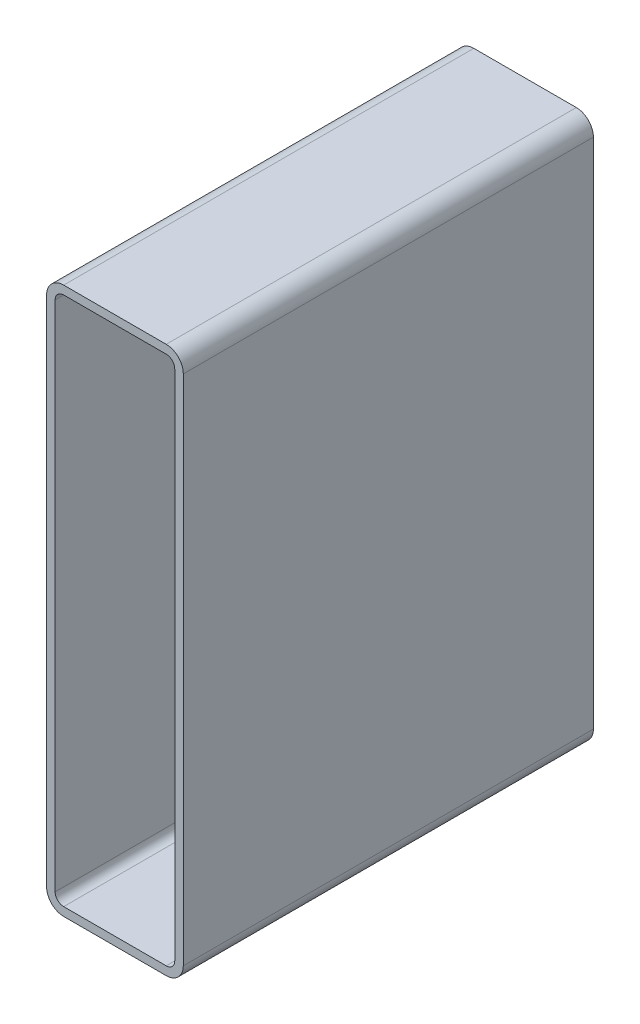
ISO-10303-21;
HEADER;
FILE_DESCRIPTION(('STEP AP214'),'2;1');
FILE_NAME('part.step','',(''),(''),'','','');
FILE_SCHEMA(('AUTOMOTIVE_DESIGN { 1 0 10303 214 1 1 1 1 }'));
ENDSEC;
DATA;
#1=APPLICATION_CONTEXT('core data for automotive mechanical design processes');
#2=APPLICATION_PROTOCOL_DEFINITION('international standard','automotive_design',2000,#1);
#3=PRODUCT_CONTEXT('',#1,'mechanical');
#4=PRODUCT('Part','Part','',(#3));
#5=PRODUCT_RELATED_PRODUCT_CATEGORY('part','',(#4));
#6=PRODUCT_DEFINITION_FORMATION('','',#4);
#7=PRODUCT_DEFINITION_CONTEXT('part definition',#1,'design');
#8=PRODUCT_DEFINITION('design','',#6,#7);
#9=PRODUCT_DEFINITION_SHAPE('','',#8);
#10=(LENGTH_UNIT() NAMED_UNIT(*) SI_UNIT(.MILLI.,.METRE.));
#11=(NAMED_UNIT(*) PLANE_ANGLE_UNIT() SI_UNIT($,.RADIAN.));
#12=(NAMED_UNIT(*) SI_UNIT($,.STERADIAN.) SOLID_ANGLE_UNIT());
#13=UNCERTAINTY_MEASURE_WITH_UNIT(LENGTH_MEASURE(1.E-05),#10,'distance_accuracy_value','');
#14=(GEOMETRIC_REPRESENTATION_CONTEXT(3) GLOBAL_UNCERTAINTY_ASSIGNED_CONTEXT((#13)) GLOBAL_UNIT_ASSIGNED_CONTEXT((#10,
#11,#12)) REPRESENTATION_CONTEXT('',''));
#15=CARTESIAN_POINT('',(0.,0.,0.));
#16=DIRECTION('',(0.,0.,1.));
#17=DIRECTION('',(1.,0.,0.));
#18=AXIS2_PLACEMENT_3D('',#15,#16,#17);
#19=CARTESIAN_POINT('',(14.3751778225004,395.482862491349,304.8));
#20=DIRECTION('',(0.,0.,1.));
#21=DIRECTION('',(1.,0.,0.));
#22=AXIS2_PLACEMENT_3D('',#19,#20,#21);
#23=PLANE('',#22);
#24=CARTESIAN_POINT('',(14.3751778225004,395.482862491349,304.8));
#25=DIRECTION('',(0.,0.,1.));
#26=DIRECTION('',(1.,0.,0.));
#27=AXIS2_PLACEMENT_3D('',#24,#25,#26);
#28=CIRCLE('',#27,12.7);
#29=CARTESIAN_POINT('',(14.3751778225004,408.182862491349,304.8));
#30=VERTEX_POINT('',#29);
#31=CARTESIAN_POINT('',(1.67517782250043,395.482862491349,304.8));
#32=VERTEX_POINT('',#31);
#33=EDGE_CURVE('E211',#30,#32,#28,.T.);
#34=ORIENTED_EDGE('',*,*,#33,.T.);
#35=DIRECTION('',(0.,-1.,0.));
#36=VECTOR('',#35,1.);
#37=CARTESIAN_POINT('',(1.67517782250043,395.482862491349,304.8));
#38=LINE('',#37,#36);
#39=CARTESIAN_POINT('',(1.67517782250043,14.4828624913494,304.8));
#40=VERTEX_POINT('',#39);
#41=EDGE_CURVE('E214',#32,#40,#38,.T.);
#42=ORIENTED_EDGE('',*,*,#41,.T.);
#43=CARTESIAN_POINT('',(14.3751778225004,14.4828624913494,304.8));
#44=DIRECTION('',(0.,0.,1.));
#45=DIRECTION('',(1.,0.,0.));
#46=AXIS2_PLACEMENT_3D('',#43,#44,#45);
#47=CIRCLE('',#46,12.7);
#48=CARTESIAN_POINT('',(14.3751778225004,1.78286249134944,304.8));
#49=VERTEX_POINT('',#48);
#50=EDGE_CURVE('E217',#40,#49,#47,.T.);
#51=ORIENTED_EDGE('',*,*,#50,.T.);
#52=DIRECTION('',(1.,0.,0.));
#53=VECTOR('',#52,1.);
#54=CARTESIAN_POINT('',(14.3751778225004,1.78286249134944,304.8));
#55=LINE('',#54,#53);
#56=CARTESIAN_POINT('',(90.5751778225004,1.78286249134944,304.8));
#57=VERTEX_POINT('',#56);
#58=EDGE_CURVE('E219',#49,#57,#55,.T.);
#59=ORIENTED_EDGE('',*,*,#58,.T.);
#60=CARTESIAN_POINT('',(90.5751778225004,14.4828624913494,304.8));
#61=DIRECTION('',(0.,0.,1.));
#62=DIRECTION('',(1.,0.,0.));
#63=AXIS2_PLACEMENT_3D('',#60,#61,#62);
#64=CIRCLE('',#63,12.7);
#65=CARTESIAN_POINT('',(103.2751778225,14.4828624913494,304.8));
#66=VERTEX_POINT('',#65);
#67=EDGE_CURVE('E221',#57,#66,#64,.T.);
#68=ORIENTED_EDGE('',*,*,#67,.T.);
#69=DIRECTION('',(0.,1.,0.));
#70=VECTOR('',#69,1.);
#71=CARTESIAN_POINT('',(103.2751778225,14.4828624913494,304.8));
#72=LINE('',#71,#70);
#73=CARTESIAN_POINT('',(103.2751778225,395.482862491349,304.8));
#74=VERTEX_POINT('',#73);
#75=EDGE_CURVE('E223',#66,#74,#72,.T.);
#76=ORIENTED_EDGE('',*,*,#75,.T.);
#77=CARTESIAN_POINT('',(90.5751778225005,395.482862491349,304.8));
#78=DIRECTION('',(0.,0.,1.));
#79=DIRECTION('',(1.,0.,0.));
#80=AXIS2_PLACEMENT_3D('',#77,#78,#79);
#81=CIRCLE('',#80,12.7);
#82=CARTESIAN_POINT('',(90.5751778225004,408.182862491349,304.8));
#83=VERTEX_POINT('',#82);
#84=EDGE_CURVE('E225',#74,#83,#81,.T.);
#85=ORIENTED_EDGE('',*,*,#84,.T.);
#86=DIRECTION('',(-1.,0.,0.));
#87=VECTOR('',#86,1.);
#88=CARTESIAN_POINT('',(90.5751778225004,408.182862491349,304.8));
#89=LINE('',#88,#87);
#90=EDGE_CURVE('E227',#83,#30,#89,.T.);
#91=ORIENTED_EDGE('',*,*,#90,.T.);
#92=EDGE_LOOP('',(#34,#42,#51,#59,#68,#76,#85,#91));
#93=FACE_BOUND('',#92,.T.);
#94=DIRECTION('',(0.,-1.,0.));
#95=VECTOR('',#94,1.);
#96=CARTESIAN_POINT('',(8.02517782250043,14.4828624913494,304.8));
#97=LINE('',#96,#95);
#98=CARTESIAN_POINT('',(8.02517782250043,395.482862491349,304.8));
#99=VERTEX_POINT('',#98);
#100=CARTESIAN_POINT('',(8.02517782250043,14.4828624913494,304.8));
#101=VERTEX_POINT('',#100);
#102=EDGE_CURVE('E154',#99,#101,#97,.T.);
#103=ORIENTED_EDGE('',*,*,#102,.F.);
#104=CARTESIAN_POINT('',(14.3751778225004,395.482862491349,304.8));
#105=DIRECTION('',(0.,0.,1.));
#106=DIRECTION('',(1.,0.,0.));
#107=AXIS2_PLACEMENT_3D('',#104,#105,#106);
#108=CIRCLE('',#107,6.35);
#109=CARTESIAN_POINT('',(14.3751778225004,401.832862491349,304.8));
#110=VERTEX_POINT('',#109);
#111=EDGE_CURVE('E146',#110,#99,#108,.T.);
#112=ORIENTED_EDGE('',*,*,#111,.F.);
#113=DIRECTION('',(-1.,0.,0.));
#114=VECTOR('',#113,1.);
#115=CARTESIAN_POINT('',(14.3751778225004,401.832862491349,304.8));
#116=LINE('',#115,#114);
#117=CARTESIAN_POINT('',(90.5751778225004,401.832862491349,304.8));
#118=VERTEX_POINT('',#117);
#119=EDGE_CURVE('E179',#118,#110,#116,.T.);
#120=ORIENTED_EDGE('',*,*,#119,.F.);
#121=CARTESIAN_POINT('',(90.5751778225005,395.482862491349,304.8));
#122=DIRECTION('',(0.,0.,1.));
#123=DIRECTION('',(1.,0.,0.));
#124=AXIS2_PLACEMENT_3D('',#121,#122,#123);
#125=CIRCLE('',#124,6.35);
#126=CARTESIAN_POINT('',(96.9251778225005,395.482862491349,304.8));
#127=VERTEX_POINT('',#126);
#128=EDGE_CURVE('E177',#127,#118,#125,.T.);
#129=ORIENTED_EDGE('',*,*,#128,.F.);
#130=DIRECTION('',(0.,1.,0.));
#131=VECTOR('',#130,1.);
#132=CARTESIAN_POINT('',(96.9251778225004,395.482862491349,304.8));
#133=LINE('',#132,#131);
#134=CARTESIAN_POINT('',(96.9251778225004,14.4828624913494,304.8));
#135=VERTEX_POINT('',#134);
#136=EDGE_CURVE('E175',#135,#127,#133,.T.);
#137=ORIENTED_EDGE('',*,*,#136,.F.);
#138=CARTESIAN_POINT('',(90.5751778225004,14.4828624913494,304.8));
#139=DIRECTION('',(0.,0.,1.));
#140=DIRECTION('',(1.,0.,0.));
#141=AXIS2_PLACEMENT_3D('',#138,#139,#140);
#142=CIRCLE('',#141,6.35000000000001);
#143=CARTESIAN_POINT('',(90.5751778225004,8.13286249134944,304.8));
#144=VERTEX_POINT('',#143);
#145=EDGE_CURVE('E173',#144,#135,#142,.T.);
#146=ORIENTED_EDGE('',*,*,#145,.F.);
#147=DIRECTION('',(1.,0.,0.));
#148=VECTOR('',#147,1.);
#149=CARTESIAN_POINT('',(90.5751778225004,8.13286249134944,304.8));
#150=LINE('',#149,#148);
#151=CARTESIAN_POINT('',(14.3751778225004,8.13286249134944,304.8));
#152=VERTEX_POINT('',#151);
#153=EDGE_CURVE('E169',#152,#144,#150,.T.);
#154=ORIENTED_EDGE('',*,*,#153,.F.);
#155=CARTESIAN_POINT('',(14.3751778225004,14.4828624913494,304.8));
#156=DIRECTION('',(0.,0.,1.));
#157=DIRECTION('',(1.,0.,0.));
#158=AXIS2_PLACEMENT_3D('',#155,#156,#157);
#159=CIRCLE('',#158,6.35);
#160=EDGE_CURVE('E167',#101,#152,#159,.T.);
#161=ORIENTED_EDGE('',*,*,#160,.F.);
#162=EDGE_LOOP('',(#103,#112,#120,#129,#137,#146,#154,#161));
#163=FACE_BOUND('',#162,.T.);
#164=ADVANCED_FACE('F33',(#93,#163),#23,.T.);
#165=CARTESIAN_POINT('',(14.3751778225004,395.482862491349,0.));
#166=DIRECTION('',(0.,0.,1.));
#167=DIRECTION('',(1.,0.,0.));
#168=AXIS2_PLACEMENT_3D('',#165,#166,#167);
#169=PLANE('',#168);
#170=CARTESIAN_POINT('',(14.3751778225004,395.482862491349,0.));
#171=DIRECTION('',(0.,0.,1.));
#172=DIRECTION('',(1.,0.,0.));
#173=AXIS2_PLACEMENT_3D('',#170,#171,#172);
#174=CIRCLE('',#173,12.7);
#175=CARTESIAN_POINT('',(14.3751778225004,408.182862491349,0.));
#176=VERTEX_POINT('',#175);
#177=CARTESIAN_POINT('',(1.67517782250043,395.482862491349,0.));
#178=VERTEX_POINT('',#177);
#179=EDGE_CURVE('E162',#176,#178,#174,.T.);
#180=ORIENTED_EDGE('',*,*,#179,.F.);
#181=DIRECTION('',(-1.,0.,0.));
#182=VECTOR('',#181,1.);
#183=CARTESIAN_POINT('',(90.5751778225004,408.182862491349,0.));
#184=LINE('',#183,#182);
#185=CARTESIAN_POINT('',(90.5751778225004,408.182862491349,0.));
#186=VERTEX_POINT('',#185);
#187=EDGE_CURVE('E215',#186,#176,#184,.T.);
#188=ORIENTED_EDGE('',*,*,#187,.F.);
#189=CARTESIAN_POINT('',(90.5751778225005,395.482862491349,0.));
#190=DIRECTION('',(0.,0.,1.));
#191=DIRECTION('',(1.,0.,0.));
#192=AXIS2_PLACEMENT_3D('',#189,#190,#191);
#193=CIRCLE('',#192,12.7);
#194=CARTESIAN_POINT('',(103.2751778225,395.482862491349,0.));
#195=VERTEX_POINT('',#194);
#196=EDGE_CURVE('E242',#195,#186,#193,.T.);
#197=ORIENTED_EDGE('',*,*,#196,.F.);
#198=DIRECTION('',(0.,1.,0.));
#199=VECTOR('',#198,1.);
#200=CARTESIAN_POINT('',(103.2751778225,14.4828624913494,0.));
#201=LINE('',#200,#199);
#202=CARTESIAN_POINT('',(103.2751778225,14.4828624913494,0.));
#203=VERTEX_POINT('',#202);
#204=EDGE_CURVE('E240',#203,#195,#201,.T.);
#205=ORIENTED_EDGE('',*,*,#204,.F.);
#206=CARTESIAN_POINT('',(90.5751778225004,14.4828624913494,0.));
#207=DIRECTION('',(0.,0.,1.));
#208=DIRECTION('',(1.,0.,0.));
#209=AXIS2_PLACEMENT_3D('',#206,#207,#208);
#210=CIRCLE('',#209,12.7);
#211=CARTESIAN_POINT('',(90.5751778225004,1.78286249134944,0.));
#212=VERTEX_POINT('',#211);
#213=EDGE_CURVE('E238',#212,#203,#210,.T.);
#214=ORIENTED_EDGE('',*,*,#213,.F.);
#215=DIRECTION('',(1.,0.,0.));
#216=VECTOR('',#215,1.);
#217=CARTESIAN_POINT('',(14.3751778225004,1.78286249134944,0.));
#218=LINE('',#217,#216);
#219=CARTESIAN_POINT('',(14.3751778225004,1.78286249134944,0.));
#220=VERTEX_POINT('',#219);
#221=EDGE_CURVE('E236',#220,#212,#218,.T.);
#222=ORIENTED_EDGE('',*,*,#221,.F.);
#223=CARTESIAN_POINT('',(14.3751778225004,14.4828624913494,0.));
#224=DIRECTION('',(0.,0.,1.));
#225=DIRECTION('',(1.,0.,0.));
#226=AXIS2_PLACEMENT_3D('',#223,#224,#225);
#227=CIRCLE('',#226,12.7);
#228=CARTESIAN_POINT('',(1.67517782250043,14.4828624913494,0.));
#229=VERTEX_POINT('',#228);
#230=EDGE_CURVE('E234',#229,#220,#227,.T.);
#231=ORIENTED_EDGE('',*,*,#230,.F.);
#232=DIRECTION('',(0.,-1.,0.));
#233=VECTOR('',#232,1.);
#234=CARTESIAN_POINT('',(1.67517782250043,395.482862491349,0.));
#235=LINE('',#234,#233);
#236=EDGE_CURVE('E232',#178,#229,#235,.T.);
#237=ORIENTED_EDGE('',*,*,#236,.F.);
#238=EDGE_LOOP('',(#180,#188,#197,#205,#214,#222,#231,#237));
#239=FACE_BOUND('',#238,.T.);
#240=CARTESIAN_POINT('',(14.3751778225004,395.482862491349,0.));
#241=DIRECTION('',(0.,0.,1.));
#242=DIRECTION('',(1.,0.,0.));
#243=AXIS2_PLACEMENT_3D('',#240,#241,#242);
#244=CIRCLE('',#243,6.35);
#245=CARTESIAN_POINT('',(14.3751778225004,401.832862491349,0.));
#246=VERTEX_POINT('',#245);
#247=CARTESIAN_POINT('',(8.02517782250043,395.482862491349,0.));
#248=VERTEX_POINT('',#247);
#249=EDGE_CURVE('E56',#246,#248,#244,.T.);
#250=ORIENTED_EDGE('',*,*,#249,.T.);
#251=DIRECTION('',(0.,-1.,0.));
#252=VECTOR('',#251,1.);
#253=CARTESIAN_POINT('',(8.02517782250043,14.4828624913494,0.));
#254=LINE('',#253,#252);
#255=CARTESIAN_POINT('',(8.02517782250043,14.4828624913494,0.));
#256=VERTEX_POINT('',#255);
#257=EDGE_CURVE('E161',#248,#256,#254,.T.);
#258=ORIENTED_EDGE('',*,*,#257,.T.);
#259=CARTESIAN_POINT('',(14.3751778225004,14.4828624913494,0.));
#260=DIRECTION('',(0.,0.,1.));
#261=DIRECTION('',(1.,0.,0.));
#262=AXIS2_PLACEMENT_3D('',#259,#260,#261);
#263=CIRCLE('',#262,6.35);
#264=CARTESIAN_POINT('',(14.3751778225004,8.13286249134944,0.));
#265=VERTEX_POINT('',#264);
#266=EDGE_CURVE('E183',#256,#265,#263,.T.);
#267=ORIENTED_EDGE('',*,*,#266,.T.);
#268=DIRECTION('',(1.,0.,0.));
#269=VECTOR('',#268,1.);
#270=CARTESIAN_POINT('',(90.5751778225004,8.13286249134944,0.));
#271=LINE('',#270,#269);
#272=CARTESIAN_POINT('',(90.5751778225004,8.13286249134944,0.));
#273=VERTEX_POINT('',#272);
#274=EDGE_CURVE('E186',#265,#273,#271,.T.);
#275=ORIENTED_EDGE('',*,*,#274,.T.);
#276=CARTESIAN_POINT('',(90.5751778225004,14.4828624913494,0.));
#277=DIRECTION('',(0.,0.,1.));
#278=DIRECTION('',(1.,0.,0.));
#279=AXIS2_PLACEMENT_3D('',#276,#277,#278);
#280=CIRCLE('',#279,6.35000000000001);
#281=CARTESIAN_POINT('',(96.9251778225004,14.4828624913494,0.));
#282=VERTEX_POINT('',#281);
#283=EDGE_CURVE('E189',#273,#282,#280,.T.);
#284=ORIENTED_EDGE('',*,*,#283,.T.);
#285=DIRECTION('',(0.,1.,0.));
#286=VECTOR('',#285,1.);
#287=CARTESIAN_POINT('',(96.9251778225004,395.482862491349,0.));
#288=LINE('',#287,#286);
#289=CARTESIAN_POINT('',(96.9251778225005,395.482862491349,0.));
#290=VERTEX_POINT('',#289);
#291=EDGE_CURVE('E192',#282,#290,#288,.T.);
#292=ORIENTED_EDGE('',*,*,#291,.T.);
#293=CARTESIAN_POINT('',(90.5751778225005,395.482862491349,0.));
#294=DIRECTION('',(0.,0.,1.));
#295=DIRECTION('',(1.,0.,0.));
#296=AXIS2_PLACEMENT_3D('',#293,#294,#295);
#297=CIRCLE('',#296,6.35);
#298=CARTESIAN_POINT('',(90.5751778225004,401.832862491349,0.));
#299=VERTEX_POINT('',#298);
#300=EDGE_CURVE('E195',#290,#299,#297,.T.);
#301=ORIENTED_EDGE('',*,*,#300,.T.);
#302=DIRECTION('',(-1.,0.,0.));
#303=VECTOR('',#302,1.);
#304=CARTESIAN_POINT('',(14.3751778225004,401.832862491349,0.));
#305=LINE('',#304,#303);
#306=EDGE_CURVE('E155',#299,#246,#305,.T.);
#307=ORIENTED_EDGE('',*,*,#306,.T.);
#308=EDGE_LOOP('',(#250,#258,#267,#275,#284,#292,#301,#307));
#309=FACE_BOUND('',#308,.T.);
#310=ADVANCED_FACE('F272',(#239,#309),#169,.F.);
#311=CARTESIAN_POINT('',(14.3751778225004,395.482862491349,304.8));
#312=DIRECTION('',(0.,0.,-1.));
#313=DIRECTION('',(-1.,0.,0.));
#314=AXIS2_PLACEMENT_3D('',#311,#312,#313);
#315=CYLINDRICAL_SURFACE('',#314,12.7);
#316=ORIENTED_EDGE('',*,*,#179,.T.);
#317=DIRECTION('',(0.,0.,-1.));
#318=VECTOR('',#317,1.);
#319=CARTESIAN_POINT('',(1.67517782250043,395.482862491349,304.8));
#320=LINE('',#319,#318);
#321=EDGE_CURVE('E11',#32,#178,#320,.T.);
#322=ORIENTED_EDGE('',*,*,#321,.F.);
#323=ORIENTED_EDGE('',*,*,#33,.F.);
#324=DIRECTION('',(0.,0.,-1.));
#325=VECTOR('',#324,1.);
#326=CARTESIAN_POINT('',(14.3751778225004,408.182862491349,304.8));
#327=LINE('',#326,#325);
#328=EDGE_CURVE('E229',#30,#176,#327,.T.);
#329=ORIENTED_EDGE('',*,*,#328,.T.);
#330=EDGE_LOOP('',(#316,#322,#323,#329));
#331=FACE_BOUND('',#330,.T.);
#332=ADVANCED_FACE('F35',(#331),#315,.T.);
#333=CARTESIAN_POINT('',(1.67517782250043,395.482862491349,304.8));
#334=DIRECTION('',(1.,0.,0.));
#335=DIRECTION('',(0.,0.,-1.));
#336=AXIS2_PLACEMENT_3D('',#333,#334,#335);
#337=PLANE('',#336);
#338=ORIENTED_EDGE('',*,*,#236,.T.);
#339=DIRECTION('',(0.,0.,-1.));
#340=VECTOR('',#339,1.);
#341=CARTESIAN_POINT('',(1.67517782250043,14.4828624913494,304.8));
#342=LINE('',#341,#340);
#343=EDGE_CURVE('E41',#40,#229,#342,.T.);
#344=ORIENTED_EDGE('',*,*,#343,.F.);
#345=ORIENTED_EDGE('',*,*,#41,.F.);
#346=ORIENTED_EDGE('',*,*,#321,.T.);
#347=EDGE_LOOP('',(#338,#344,#345,#346));
#348=FACE_BOUND('',#347,.T.);
#349=ADVANCED_FACE('F289',(#348),#337,.F.);
#350=CARTESIAN_POINT('',(14.3751778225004,14.4828624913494,304.8));
#351=DIRECTION('',(0.,0.,-1.));
#352=DIRECTION('',(-1.,0.,0.));
#353=AXIS2_PLACEMENT_3D('',#350,#351,#352);
#354=CYLINDRICAL_SURFACE('',#353,12.7);
#355=ORIENTED_EDGE('',*,*,#230,.T.);
#356=DIRECTION('',(0.,0.,-1.));
#357=VECTOR('',#356,1.);
#358=CARTESIAN_POINT('',(14.3751778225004,1.78286249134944,304.8));
#359=LINE('',#358,#357);
#360=EDGE_CURVE('E259',#49,#220,#359,.T.);
#361=ORIENTED_EDGE('',*,*,#360,.F.);
#362=ORIENTED_EDGE('',*,*,#50,.F.);
#363=ORIENTED_EDGE('',*,*,#343,.T.);
#364=EDGE_LOOP('',(#355,#361,#362,#363));
#365=FACE_BOUND('',#364,.T.);
#366=ADVANCED_FACE('F266',(#365),#354,.T.);
#367=CARTESIAN_POINT('',(14.3751778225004,1.78286249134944,304.8));
#368=DIRECTION('',(0.,1.,0.));
#369=DIRECTION('',(0.,0.,1.));
#370=AXIS2_PLACEMENT_3D('',#367,#368,#369);
#371=PLANE('',#370);
#372=ORIENTED_EDGE('',*,*,#221,.T.);
#373=DIRECTION('',(0.,0.,-1.));
#374=VECTOR('',#373,1.);
#375=CARTESIAN_POINT('',(90.5751778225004,1.78286249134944,304.8));
#376=LINE('',#375,#374);
#377=EDGE_CURVE('E256',#57,#212,#376,.T.);
#378=ORIENTED_EDGE('',*,*,#377,.F.);
#379=ORIENTED_EDGE('',*,*,#58,.F.);
#380=ORIENTED_EDGE('',*,*,#360,.T.);
#381=EDGE_LOOP('',(#372,#378,#379,#380));
#382=FACE_BOUND('',#381,.T.);
#383=ADVANCED_FACE('F278',(#382),#371,.F.);
#384=CARTESIAN_POINT('',(90.5751778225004,14.4828624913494,304.8));
#385=DIRECTION('',(0.,0.,-1.));
#386=DIRECTION('',(-1.,0.,0.));
#387=AXIS2_PLACEMENT_3D('',#384,#385,#386);
#388=CYLINDRICAL_SURFACE('',#387,12.7);
#389=ORIENTED_EDGE('',*,*,#213,.T.);
#390=DIRECTION('',(0.,0.,-1.));
#391=VECTOR('',#390,1.);
#392=CARTESIAN_POINT('',(103.2751778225,14.4828624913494,304.8));
#393=LINE('',#392,#391);
#394=EDGE_CURVE('E253',#66,#203,#393,.T.);
#395=ORIENTED_EDGE('',*,*,#394,.F.);
#396=ORIENTED_EDGE('',*,*,#67,.F.);
#397=ORIENTED_EDGE('',*,*,#377,.T.);
#398=EDGE_LOOP('',(#389,#395,#396,#397));
#399=FACE_BOUND('',#398,.T.);
#400=ADVANCED_FACE('F282',(#399),#388,.T.);
#401=CARTESIAN_POINT('',(103.2751778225,14.4828624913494,304.8));
#402=DIRECTION('',(-1.,0.,0.));
#403=DIRECTION('',(0.,0.,1.));
#404=AXIS2_PLACEMENT_3D('',#401,#402,#403);
#405=PLANE('',#404);
#406=ORIENTED_EDGE('',*,*,#204,.T.);
#407=DIRECTION('',(0.,0.,-1.));
#408=VECTOR('',#407,1.);
#409=CARTESIAN_POINT('',(103.2751778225,395.482862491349,304.8));
#410=LINE('',#409,#408);
#411=EDGE_CURVE('E250',#74,#195,#410,.T.);
#412=ORIENTED_EDGE('',*,*,#411,.F.);
#413=ORIENTED_EDGE('',*,*,#75,.F.);
#414=ORIENTED_EDGE('',*,*,#394,.T.);
#415=EDGE_LOOP('',(#406,#412,#413,#414));
#416=FACE_BOUND('',#415,.T.);
#417=ADVANCED_FACE('F302',(#416),#405,.F.);
#418=CARTESIAN_POINT('',(90.5751778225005,395.482862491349,304.8));
#419=DIRECTION('',(0.,0.,-1.));
#420=DIRECTION('',(-1.,0.,0.));
#421=AXIS2_PLACEMENT_3D('',#418,#419,#420);
#422=CYLINDRICAL_SURFACE('',#421,12.7);
#423=ORIENTED_EDGE('',*,*,#196,.T.);
#424=DIRECTION('',(0.,0.,-1.));
#425=VECTOR('',#424,1.);
#426=CARTESIAN_POINT('',(90.5751778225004,408.182862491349,304.8));
#427=LINE('',#426,#425);
#428=EDGE_CURVE('E247',#83,#186,#427,.T.);
#429=ORIENTED_EDGE('',*,*,#428,.F.);
#430=ORIENTED_EDGE('',*,*,#84,.F.);
#431=ORIENTED_EDGE('',*,*,#411,.T.);
#432=EDGE_LOOP('',(#423,#429,#430,#431));
#433=FACE_BOUND('',#432,.T.);
#434=ADVANCED_FACE('F300',(#433),#422,.T.);
#435=CARTESIAN_POINT('',(90.5751778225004,408.182862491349,304.8));
#436=DIRECTION('',(0.,-1.,0.));
#437=DIRECTION('',(0.,0.,-1.));
#438=AXIS2_PLACEMENT_3D('',#435,#436,#437);
#439=PLANE('',#438);
#440=ORIENTED_EDGE('',*,*,#187,.T.);
#441=ORIENTED_EDGE('',*,*,#328,.F.);
#442=ORIENTED_EDGE('',*,*,#90,.F.);
#443=ORIENTED_EDGE('',*,*,#428,.T.);
#444=EDGE_LOOP('',(#440,#441,#442,#443));
#445=FACE_BOUND('',#444,.T.);
#446=ADVANCED_FACE('F295',(#445),#439,.F.);
#447=CARTESIAN_POINT('',(14.3751778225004,395.482862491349,304.8));
#448=DIRECTION('',(0.,0.,-1.));
#449=DIRECTION('',(-1.,0.,0.));
#450=AXIS2_PLACEMENT_3D('',#447,#448,#449);
#451=CYLINDRICAL_SURFACE('',#450,6.35);
#452=ORIENTED_EDGE('',*,*,#249,.F.);
#453=DIRECTION('',(0.,0.,-1.));
#454=VECTOR('',#453,1.);
#455=CARTESIAN_POINT('',(14.3751778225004,401.832862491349,304.8));
#456=LINE('',#455,#454);
#457=EDGE_CURVE('E150',#110,#246,#456,.T.);
#458=ORIENTED_EDGE('',*,*,#457,.F.);
#459=ORIENTED_EDGE('',*,*,#111,.T.);
#460=DIRECTION('',(0.,0.,-1.));
#461=VECTOR('',#460,1.);
#462=CARTESIAN_POINT('',(8.02517782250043,395.482862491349,304.8));
#463=LINE('',#462,#461);
#464=EDGE_CURVE('E149',#99,#248,#463,.T.);
#465=ORIENTED_EDGE('',*,*,#464,.T.);
#466=EDGE_LOOP('',(#452,#458,#459,#465));
#467=FACE_BOUND('',#466,.T.);
#468=ADVANCED_FACE('F148',(#467),#451,.F.);
#469=CARTESIAN_POINT('',(8.02517782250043,14.4828624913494,304.8));
#470=DIRECTION('',(1.,0.,0.));
#471=DIRECTION('',(0.,0.,-1.));
#472=AXIS2_PLACEMENT_3D('',#469,#470,#471);
#473=PLANE('',#472);
#474=ORIENTED_EDGE('',*,*,#257,.F.);
#475=ORIENTED_EDGE('',*,*,#464,.F.);
#476=ORIENTED_EDGE('',*,*,#102,.T.);
#477=DIRECTION('',(0.,0.,-1.));
#478=VECTOR('',#477,1.);
#479=CARTESIAN_POINT('',(8.02517782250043,14.4828624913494,304.8));
#480=LINE('',#479,#478);
#481=EDGE_CURVE('E163',#101,#256,#480,.T.);
#482=ORIENTED_EDGE('',*,*,#481,.T.);
#483=EDGE_LOOP('',(#474,#475,#476,#482));
#484=FACE_BOUND('',#483,.T.);
#485=ADVANCED_FACE('F158',(#484),#473,.T.);
#486=CARTESIAN_POINT('',(14.3751778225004,14.4828624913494,304.8));
#487=DIRECTION('',(0.,0.,-1.));
#488=DIRECTION('',(-1.,0.,0.));
#489=AXIS2_PLACEMENT_3D('',#486,#487,#488);
#490=CYLINDRICAL_SURFACE('',#489,6.35);
#491=ORIENTED_EDGE('',*,*,#266,.F.);
#492=ORIENTED_EDGE('',*,*,#481,.F.);
#493=ORIENTED_EDGE('',*,*,#160,.T.);
#494=DIRECTION('',(0.,0.,-1.));
#495=VECTOR('',#494,1.);
#496=CARTESIAN_POINT('',(14.3751778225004,8.13286249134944,304.8));
#497=LINE('',#496,#495);
#498=EDGE_CURVE('E208',#152,#265,#497,.T.);
#499=ORIENTED_EDGE('',*,*,#498,.T.);
#500=EDGE_LOOP('',(#491,#492,#493,#499));
#501=FACE_BOUND('',#500,.T.);
#502=ADVANCED_FACE('F327',(#501),#490,.F.);
#503=CARTESIAN_POINT('',(90.5751778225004,8.13286249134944,304.8));
#504=DIRECTION('',(0.,1.,0.));
#505=DIRECTION('',(0.,0.,1.));
#506=AXIS2_PLACEMENT_3D('',#503,#504,#505);
#507=PLANE('',#506);
#508=ORIENTED_EDGE('',*,*,#274,.F.);
#509=ORIENTED_EDGE('',*,*,#498,.F.);
#510=ORIENTED_EDGE('',*,*,#153,.T.);
#511=DIRECTION('',(0.,0.,-1.));
#512=VECTOR('',#511,1.);
#513=CARTESIAN_POINT('',(90.5751778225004,8.13286249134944,304.8));
#514=LINE('',#513,#512);
#515=EDGE_CURVE('E206',#144,#273,#514,.T.);
#516=ORIENTED_EDGE('',*,*,#515,.T.);
#517=EDGE_LOOP('',(#508,#509,#510,#516));
#518=FACE_BOUND('',#517,.T.);
#519=ADVANCED_FACE('F331',(#518),#507,.T.);
#520=CARTESIAN_POINT('',(90.5751778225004,14.4828624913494,304.8));
#521=DIRECTION('',(0.,0.,-1.));
#522=DIRECTION('',(-1.,0.,0.));
#523=AXIS2_PLACEMENT_3D('',#520,#521,#522);
#524=CYLINDRICAL_SURFACE('',#523,6.35000000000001);
#525=ORIENTED_EDGE('',*,*,#283,.F.);
#526=ORIENTED_EDGE('',*,*,#515,.F.);
#527=ORIENTED_EDGE('',*,*,#145,.T.);
#528=DIRECTION('',(0.,0.,-1.));
#529=VECTOR('',#528,1.);
#530=CARTESIAN_POINT('',(96.9251778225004,14.4828624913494,304.8));
#531=LINE('',#530,#529);
#532=EDGE_CURVE('E204',#135,#282,#531,.T.);
#533=ORIENTED_EDGE('',*,*,#532,.T.);
#534=EDGE_LOOP('',(#525,#526,#527,#533));
#535=FACE_BOUND('',#534,.T.);
#536=ADVANCED_FACE('F337',(#535),#524,.F.);
#537=CARTESIAN_POINT('',(96.9251778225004,395.482862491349,304.8));
#538=DIRECTION('',(-1.,0.,0.));
#539=DIRECTION('',(0.,0.,1.));
#540=AXIS2_PLACEMENT_3D('',#537,#538,#539);
#541=PLANE('',#540);
#542=ORIENTED_EDGE('',*,*,#291,.F.);
#543=ORIENTED_EDGE('',*,*,#532,.F.);
#544=ORIENTED_EDGE('',*,*,#136,.T.);
#545=DIRECTION('',(0.,0.,-1.));
#546=VECTOR('',#545,1.);
#547=CARTESIAN_POINT('',(96.9251778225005,395.482862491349,304.8));
#548=LINE('',#547,#546);
#549=EDGE_CURVE('E202',#127,#290,#548,.T.);
#550=ORIENTED_EDGE('',*,*,#549,.T.);
#551=EDGE_LOOP('',(#542,#543,#544,#550));
#552=FACE_BOUND('',#551,.T.);
#553=ADVANCED_FACE('F341',(#552),#541,.T.);
#554=CARTESIAN_POINT('',(90.5751778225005,395.482862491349,304.8));
#555=DIRECTION('',(0.,0.,-1.));
#556=DIRECTION('',(-1.,0.,0.));
#557=AXIS2_PLACEMENT_3D('',#554,#555,#556);
#558=CYLINDRICAL_SURFACE('',#557,6.35);
#559=ORIENTED_EDGE('',*,*,#300,.F.);
#560=ORIENTED_EDGE('',*,*,#549,.F.);
#561=ORIENTED_EDGE('',*,*,#128,.T.);
#562=DIRECTION('',(0.,0.,-1.));
#563=VECTOR('',#562,1.);
#564=CARTESIAN_POINT('',(90.5751778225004,401.832862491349,304.8));
#565=LINE('',#564,#563);
#566=EDGE_CURVE('E48',#118,#299,#565,.T.);
#567=ORIENTED_EDGE('',*,*,#566,.T.);
#568=EDGE_LOOP('',(#559,#560,#561,#567));
#569=FACE_BOUND('',#568,.T.);
#570=ADVANCED_FACE('F345',(#569),#558,.F.);
#571=CARTESIAN_POINT('',(14.3751778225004,401.832862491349,304.8));
#572=DIRECTION('',(0.,-1.,0.));
#573=DIRECTION('',(0.,0.,-1.));
#574=AXIS2_PLACEMENT_3D('',#571,#572,#573);
#575=PLANE('',#574);
#576=ORIENTED_EDGE('',*,*,#306,.F.);
#577=ORIENTED_EDGE('',*,*,#566,.F.);
#578=ORIENTED_EDGE('',*,*,#119,.T.);
#579=ORIENTED_EDGE('',*,*,#457,.T.);
#580=EDGE_LOOP('',(#576,#577,#578,#579));
#581=FACE_BOUND('',#580,.T.);
#582=ADVANCED_FACE('F349',(#581),#575,.T.);
#583=CLOSED_SHELL('',(#164,#310,#332,#349,#366,#383,#400,#417,#434,#446,#468,#485,#502,#519,
#536,#553,#570,#582));
#584=MANIFOLD_SOLID_BREP('B2',#583);
#585=ADVANCED_BREP_SHAPE_REPRESENTATION('',(#18,#584),#14);
#586=SHAPE_DEFINITION_REPRESENTATION(#9,#585);
ENDSEC;
END-ISO-10303-21;
